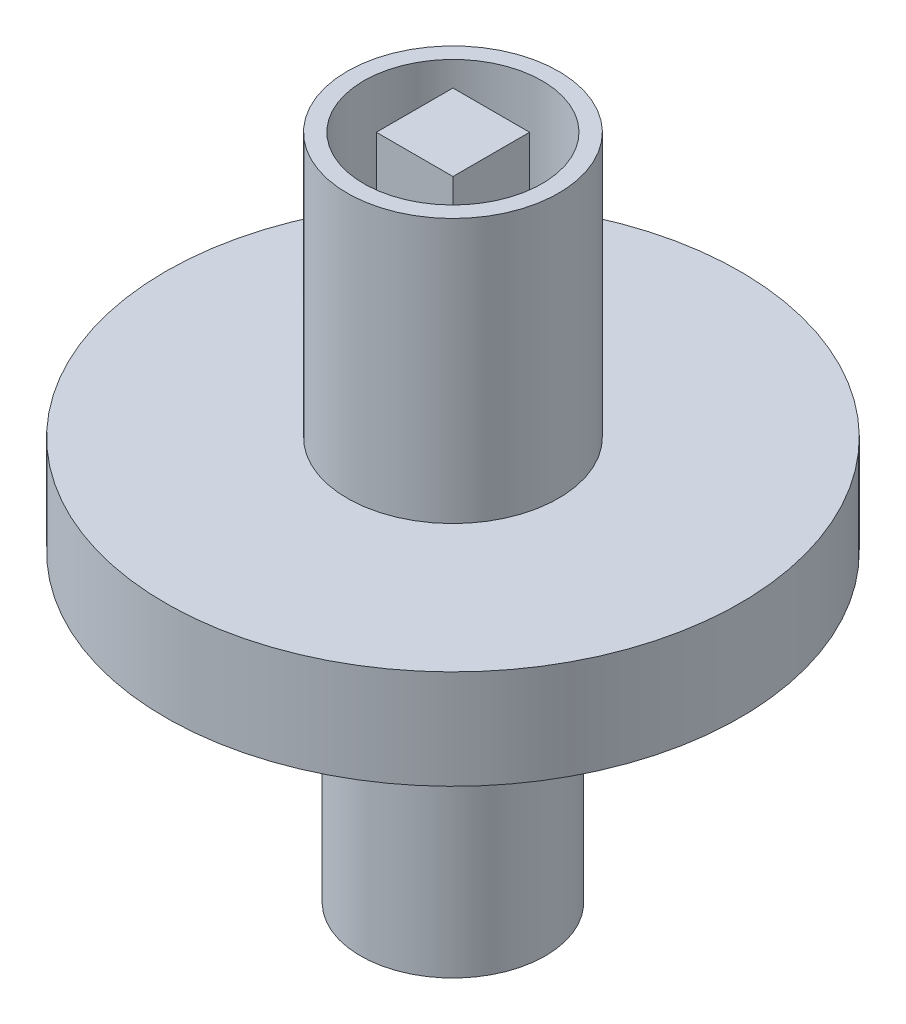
from build123d import *

# Parameters (mm, degrees)
SKETCH3_R           = 6.75
CUT_EXTRUDE1_DEPTH  = 15
SKETCH4_W           = 5.8
SKETCH4_H           = 5.8
BOSS_EXTRUDE1_DEPTH = 15
SKETCH6_R           = 7
BOSS_EXTRUDE2_DEPTH = 23
SKETCH7_R           = 3.5
CUT_EXTRUDE2_DEPTH  = 15
CUT_EXTRUDE3_DEPTH  = 15


with BuildPart() as part:
    # Sketch2 → Revolve2 (revolve)
    with BuildSketch(Plane.XY, mode=Mode.PRIVATE) as revolve2_sk:
        Polygon((21.75, 0), (21.75, 7.5), (8, 7.5), (8, 27.5), (0, 27.5), (0, 0), align=None)
    revolve(revolve2_sk.sketch.rotate(Axis((0, 96.27972973, 0), (0, -1, 0)), 180), axis=Axis((0, 96.27972973, 0), (0, -1, 0)))

    # Sketch3 → Cut-Extrude1 (cut)
    with BuildSketch(Plane(origin=(0, 27.5, 0), x_dir=(1, 0, 0), z_dir=(0, 1, 0))):
        with Locations(Location((0, 0, 0), (0, 0, 180))):
            Circle(SKETCH3_R)
    extrude(amount=-CUT_EXTRUDE1_DEPTH, mode=Mode.SUBTRACT)

    # Sketch4 → Boss-Extrude1 (add)
    with BuildSketch(Plane(origin=(0, 12.5, 0), x_dir=(1, 0, 0), z_dir=(0, 1, 0))):
        with Locations((0.004761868, -0.002625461)):
            Rectangle(SKETCH4_W, SKETCH4_H)
    extrude(amount=BOSS_EXTRUDE1_DEPTH)

    # Sketch6 → Boss-Extrude2 (add)
    with BuildSketch(Plane.XZ):
        Circle(SKETCH6_R)
    extrude(amount=BOSS_EXTRUDE2_DEPTH)

    # Sketch7 → Cut-Extrude2 (cut)
    with BuildSketch(Plane.XZ.offset(23)):
        Circle(SKETCH7_R)
    extrude(amount=-CUT_EXTRUDE2_DEPTH, mode=Mode.SUBTRACT)

    # Sketch8 → Cut-Extrude3 (cut)
    with BuildSketch(Plane.XZ.offset(23)):
        Polygon((-5.3, 1.5), (-1.5, 1.5), (-1.5, 5.3), (1.5, 5.3), (1.5, 1.5), (5.3, 1.5), (5.3, -1.5), (1.5, -1.5), (1.5, -5.3), (-1.5, -5.3), (-1.5, -1.5), (-5.3, -1.5), align=None)
    extrude(amount=-CUT_EXTRUDE3_DEPTH, mode=Mode.SUBTRACT)


solid = part.part
